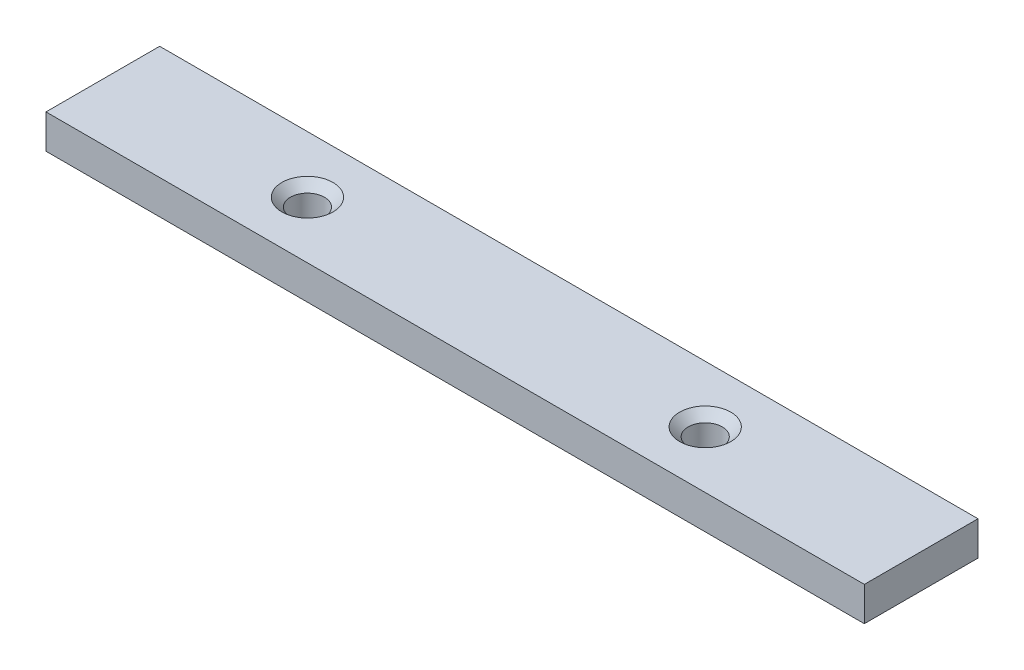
from build123d import *

# Parameters (mm, degrees)
SKETCH1_W                                            = 144
SKETCH1_H                                            = 20
BOSS_EXTRUDE1_DEPTH                                  = 6
CSK_FOR_M1_6_COUNTERSUNK_FLAT_HEAD_SCREW_D           = 6
CSK_FOR_M1_6_COUNTERSUNK_FLAT_HEAD_SCREW_CSINK_D     = 9
CSK_FOR_M1_6_COUNTERSUNK_FLAT_HEAD_SCREW_CSINK_ANGLE = 90


with BuildPart() as part:
    # Sketch1 → Boss-Extrude1 (new body)
    with BuildSketch(Plane(origin=(0, 0, 0), x_dir=(1, 0, 0), z_dir=(0, 1, 0))):
        Rectangle(SKETCH1_W, SKETCH1_H)
    extrude(amount=BOSS_EXTRUDE1_DEPTH)

    # CSK for M1.6 Countersunk Flat Head Screw (through all)
    with Locations(Plane(origin=(0, 6, 0), x_dir=(-1, 0, 0), z_dir=(0, 1, 0))):
        with Locations((36, 0), (-34, 0)):
            CounterSinkHole(CSK_FOR_M1_6_COUNTERSUNK_FLAT_HEAD_SCREW_D / 2, CSK_FOR_M1_6_COUNTERSUNK_FLAT_HEAD_SCREW_CSINK_D / 2, counter_sink_angle=CSK_FOR_M1_6_COUNTERSUNK_FLAT_HEAD_SCREW_CSINK_ANGLE)


solid = part.part
